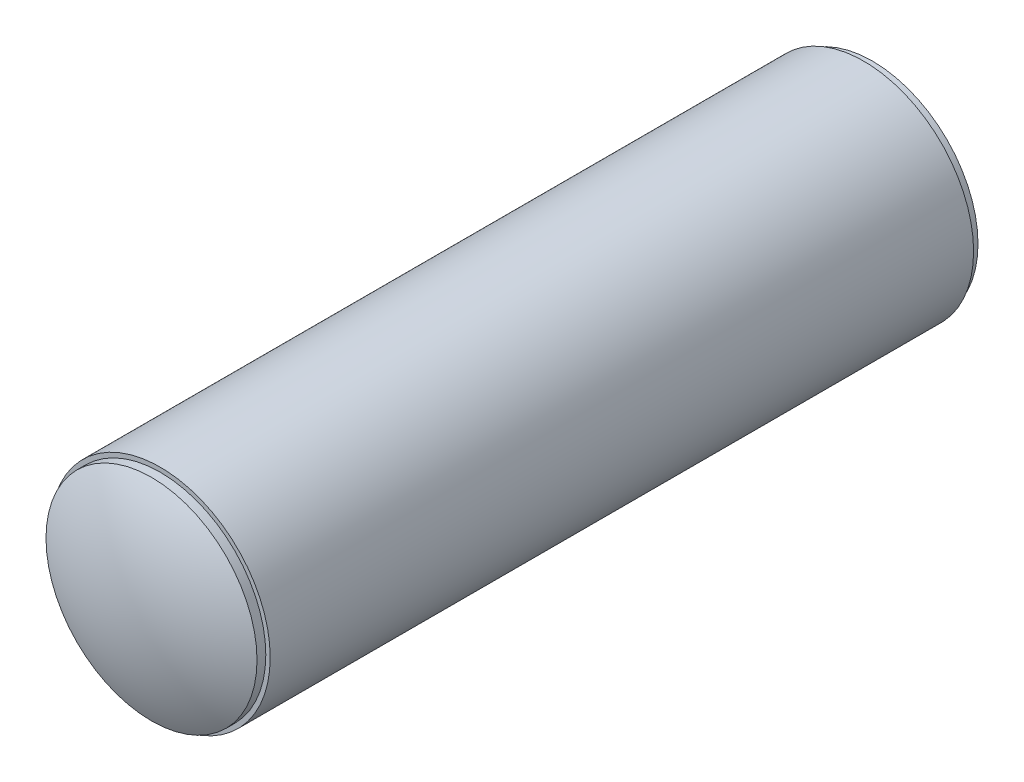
from build123d import *

# Parameters (mm, degrees)
SKETCH1_R           = 2.5
SKETCH1_R_2         = 1
BOSS_EXTRUDE1_DEPTH = 8


with BuildPart() as part:
    # Sketch1 → Boss-Extrude1 (new, symmetric)
    with BuildSketch(Plane.XY):
        Circle(SKETCH1_R)
        Circle(SKETCH1_R_2, mode=Mode.SUBTRACT)
    extrude(amount=BOSS_EXTRUDE1_DEPTH, both=True)


with BuildPart() as body_2:
    # Sketch2 → Revolve1 (revolve)
    with BuildSketch(Plane(origin=(0, 0, 0), x_dir=(0, 0, -1), z_dir=(1, 0, 0))):
        with BuildLine():
            Line((-8.8, 0), (-5, 0))
            Line((-5, 0), (-5, -1))
            Line((-5, -1), (-8, -1))
            Line((-8, -1), (-8, -2.4))
            Line((-8, -2.4), (-8.2, -2.4))
            ThreePointArc((-8.2, -2.4), (-8.647726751, -1.236931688), (-8.8, 0))
        make_face()
        with BuildLine():
            Line((8.2, -2.4), (8, -2.4))
            Line((8, -2.4), (8, -1))
            Line((8, -1), (5, -1))
            Line((5, -1), (5, 0))
            Line((5, 0), (8.8, 0))
            ThreePointArc((8.8, 0), (8.647726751, -1.236931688), (8.2, -2.4))
        make_face()
    revolve(axis=Axis((0, 0, 8.8), (0, 0, -1)))


solid = Compound([part.part, body_2.part])
